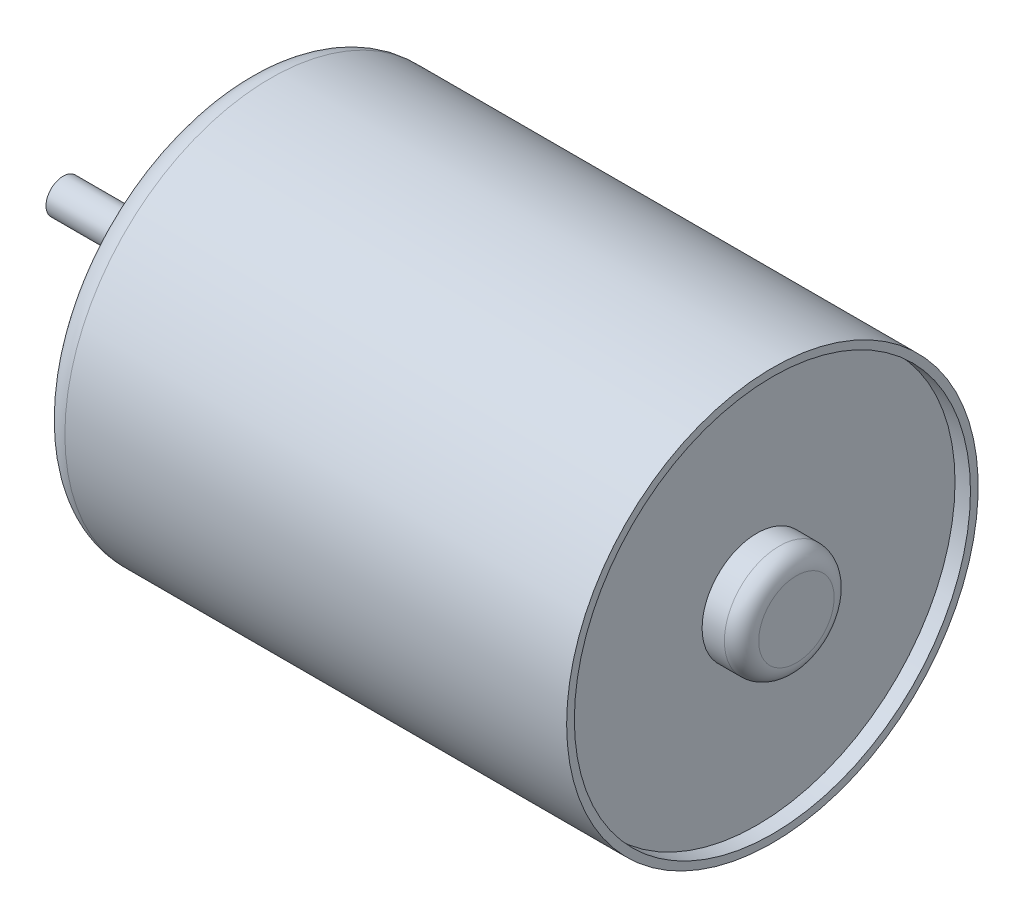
from build123d import *

# Parameters (mm, degrees)
CONG_1_R           = 1.5
BOSS_EXTRU_1_START = 2.3
ESQUISSE2_R        = 3.2
BOSS_EXTRU_1_DEPTH = 2.3
CONG_2_R           = 1


with BuildPart() as part:
    # Esquisse1 → R_volution1 (revolve)
    with BuildSketch(Plane.XY, mode=Mode.PRIVATE) as r_volution1_sk:
        Polygon((-41.536162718, 27.166943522), (-41.536162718, 28.166943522), (-32.036162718, 28.166943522), (-32.036162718, 29.766943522), (-32.536162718, 29.766943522), (-32.536162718, 30.366943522), (-30.936162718, 30.366943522), (-30.936162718, 39.166943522), (-0.176162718, 39.166943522), (-0.176162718, 38.716943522), (-1.076162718, 38.716943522), (-1.076162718, 27.166943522), align=None)
    revolve(r_volution1_sk.sketch.rotate(Axis((-41.536162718, 27.166943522, 0), (1, 0, 0)), 90), axis=Axis((-41.536162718, 27.166943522, 0), (1, 0, 0)))

    # Cong_1
    cong_1_edges = [part.edges().sort_by_distance(p)[0] for p in [
        (-30.936162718, 27.166943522, -12),
    ]]
    fillet(cong_1_edges, radius=CONG_1_R)

    # Esquisse2 → Boss.-Extru.1 (add)
    with BuildSketch(Plane(origin=(-1.076162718, 0, 0), x_dir=(0, 0, -1), z_dir=(1, 0, 0)).offset(BOSS_EXTRU_1_START)):
        with Locations(Location((0, 27.166943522, 0), (0, 0, 180))):
            Circle(ESQUISSE2_R)
    extrude(amount=-BOSS_EXTRU_1_DEPTH)

    # Cong_2
    cong_2_edges = [part.edges().sort_by_distance(p)[0] for p in [
        (1.223837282, 27.166943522, -3.2),
    ]]
    fillet(cong_2_edges, radius=CONG_2_R)


solid = part.part
